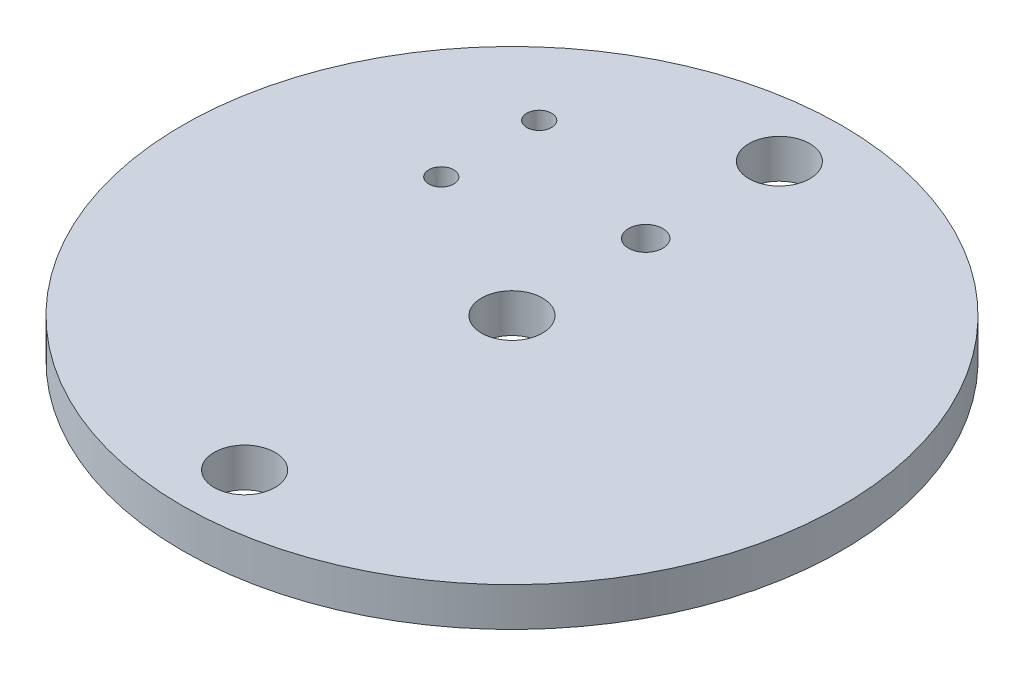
ISO-10303-21;
HEADER;
FILE_DESCRIPTION(('STEP AP214'),'2;1');
FILE_NAME('part.step','',(''),(''),'','','');
FILE_SCHEMA(('AUTOMOTIVE_DESIGN { 1 0 10303 214 1 1 1 1 }'));
ENDSEC;
DATA;
#1=APPLICATION_CONTEXT('core data for automotive mechanical design processes');
#2=APPLICATION_PROTOCOL_DEFINITION('international standard','automotive_design',2000,#1);
#3=PRODUCT_CONTEXT('',#1,'mechanical');
#4=PRODUCT('Part','Part','',(#3));
#5=PRODUCT_RELATED_PRODUCT_CATEGORY('part','',(#4));
#6=PRODUCT_DEFINITION_FORMATION('','',#4);
#7=PRODUCT_DEFINITION_CONTEXT('part definition',#1,'design');
#8=PRODUCT_DEFINITION('design','',#6,#7);
#9=PRODUCT_DEFINITION_SHAPE('','',#8);
#10=(LENGTH_UNIT() NAMED_UNIT(*) SI_UNIT(.MILLI.,.METRE.));
#11=(NAMED_UNIT(*) PLANE_ANGLE_UNIT() SI_UNIT($,.RADIAN.));
#12=(NAMED_UNIT(*) SI_UNIT($,.STERADIAN.) SOLID_ANGLE_UNIT());
#13=UNCERTAINTY_MEASURE_WITH_UNIT(LENGTH_MEASURE(1.E-05),#10,'distance_accuracy_value','');
#14=(GEOMETRIC_REPRESENTATION_CONTEXT(3) GLOBAL_UNCERTAINTY_ASSIGNED_CONTEXT((#13)) GLOBAL_UNIT_ASSIGNED_CONTEXT((#10,
#11,#12)) REPRESENTATION_CONTEXT('',''));
#15=CARTESIAN_POINT('',(0.,0.,0.));
#16=DIRECTION('',(0.,0.,1.));
#17=DIRECTION('',(1.,0.,0.));
#18=AXIS2_PLACEMENT_3D('',#15,#16,#17);
#19=CARTESIAN_POINT('',(0.,3.175,0.));
#20=DIRECTION('',(0.,-1.,0.));
#21=DIRECTION('',(0.,0.,-1.));
#22=AXIS2_PLACEMENT_3D('',#19,#20,#21);
#23=CYLINDRICAL_SURFACE('',#22,26.924);
#24=CARTESIAN_POINT('',(0.,3.175,0.));
#25=DIRECTION('',(0.,1.,0.));
#26=DIRECTION('',(0.,0.,1.));
#27=AXIS2_PLACEMENT_3D('',#24,#25,#26);
#28=CIRCLE('',#27,26.924);
#29=CARTESIAN_POINT('',(0.,3.175,26.924));
#30=VERTEX_POINT('',#29);
#31=EDGE_CURVE('E10',#30,#30,#28,.T.);
#32=ORIENTED_EDGE('',*,*,#31,.F.);
#33=EDGE_LOOP('',(#32));
#34=FACE_BOUND('',#33,.T.);
#35=CARTESIAN_POINT('',(0.,0.,0.));
#36=DIRECTION('',(0.,1.,0.));
#37=DIRECTION('',(0.,0.,1.));
#38=AXIS2_PLACEMENT_3D('',#35,#36,#37);
#39=CIRCLE('',#38,26.924);
#40=CARTESIAN_POINT('',(0.,0.,26.924));
#41=VERTEX_POINT('',#40);
#42=EDGE_CURVE('E42',#41,#41,#39,.T.);
#43=ORIENTED_EDGE('',*,*,#42,.T.);
#44=EDGE_LOOP('',(#43));
#45=FACE_BOUND('',#44,.T.);
#46=ADVANCED_FACE('F39',(#34,#45),#23,.T.);
#47=CARTESIAN_POINT('',(0.,3.175,0.));
#48=DIRECTION('',(0.,1.,0.));
#49=DIRECTION('',(0.,0.,1.));
#50=AXIS2_PLACEMENT_3D('',#47,#48,#49);
#51=PLANE('',#50);
#52=CARTESIAN_POINT('',(0.,3.175,-10.922));
#53=DIRECTION('',(0.,1.,0.));
#54=DIRECTION('',(0.,0.,1.));
#55=AXIS2_PLACEMENT_3D('',#52,#53,#54);
#56=CIRCLE('',#55,1.4);
#57=CARTESIAN_POINT('',(0.,3.175,-9.522));
#58=VERTEX_POINT('',#57);
#59=EDGE_CURVE('E93',#58,#58,#56,.T.);
#60=ORIENTED_EDGE('',*,*,#59,.F.);
#61=EDGE_LOOP('',(#60));
#62=FACE_BOUND('',#61,.T.);
#63=CARTESIAN_POINT('',(-12.7,3.175,-14.922));
#64=DIRECTION('',(0.,1.,0.));
#65=DIRECTION('',(0.,0.,1.));
#66=AXIS2_PLACEMENT_3D('',#63,#64,#65);
#67=CIRCLE('',#66,1.016);
#68=CARTESIAN_POINT('',(-12.7,3.175,-13.906));
#69=VERTEX_POINT('',#68);
#70=EDGE_CURVE('E85',#69,#69,#67,.T.);
#71=ORIENTED_EDGE('',*,*,#70,.F.);
#72=EDGE_LOOP('',(#71));
#73=FACE_BOUND('',#72,.T.);
#74=CARTESIAN_POINT('',(-12.7,3.175,-6.922));
#75=DIRECTION('',(0.,1.,0.));
#76=DIRECTION('',(0.,0.,1.));
#77=AXIS2_PLACEMENT_3D('',#74,#75,#76);
#78=CIRCLE('',#77,1.016);
#79=CARTESIAN_POINT('',(-12.7,3.175,-5.906));
#80=VERTEX_POINT('',#79);
#81=EDGE_CURVE('E77',#80,#80,#78,.T.);
#82=ORIENTED_EDGE('',*,*,#81,.F.);
#83=EDGE_LOOP('',(#82));
#84=FACE_BOUND('',#83,.T.);
#85=CARTESIAN_POINT('',(0.,3.175,0.));
#86=DIRECTION('',(0.,1.,0.));
#87=DIRECTION('',(0.,0.,1.));
#88=AXIS2_PLACEMENT_3D('',#85,#86,#87);
#89=CIRCLE('',#88,2.4892);
#90=CARTESIAN_POINT('',(0.,3.175,2.4892));
#91=VERTEX_POINT('',#90);
#92=EDGE_CURVE('E72',#91,#91,#89,.T.);
#93=ORIENTED_EDGE('',*,*,#92,.F.);
#94=EDGE_LOOP('',(#93));
#95=FACE_BOUND('',#94,.T.);
#96=CARTESIAN_POINT('',(0.,3.175,21.844));
#97=DIRECTION('',(0.,1.,0.));
#98=DIRECTION('',(0.,0.,1.));
#99=AXIS2_PLACEMENT_3D('',#96,#97,#98);
#100=CIRCLE('',#99,2.4892);
#101=CARTESIAN_POINT('',(0.,3.175,24.3332));
#102=VERTEX_POINT('',#101);
#103=EDGE_CURVE('E64',#102,#102,#100,.T.);
#104=ORIENTED_EDGE('',*,*,#103,.F.);
#105=EDGE_LOOP('',(#104));
#106=FACE_BOUND('',#105,.T.);
#107=CARTESIAN_POINT('',(0.,3.175,-21.844));
#108=DIRECTION('',(0.,1.,0.));
#109=DIRECTION('',(0.,0.,1.));
#110=AXIS2_PLACEMENT_3D('',#107,#108,#109);
#111=CIRCLE('',#110,2.4892);
#112=CARTESIAN_POINT('',(0.,3.175,-19.3548));
#113=VERTEX_POINT('',#112);
#114=EDGE_CURVE('E56',#113,#113,#111,.T.);
#115=ORIENTED_EDGE('',*,*,#114,.F.);
#116=EDGE_LOOP('',(#115));
#117=FACE_BOUND('',#116,.T.);
#118=ORIENTED_EDGE('',*,*,#31,.T.);
#119=EDGE_LOOP('',(#118));
#120=FACE_BOUND('',#119,.T.);
#121=ADVANCED_FACE('F111',(#62,#73,#84,#95,#106,#117,#120),#51,.T.);
#122=CARTESIAN_POINT('',(0.,0.,0.));
#123=DIRECTION('',(0.,1.,0.));
#124=DIRECTION('',(0.,0.,1.));
#125=AXIS2_PLACEMENT_3D('',#122,#123,#124);
#126=PLANE('',#125);
#127=CARTESIAN_POINT('',(0.,0.,-10.922));
#128=DIRECTION('',(0.,1.,0.));
#129=DIRECTION('',(0.,0.,1.));
#130=AXIS2_PLACEMENT_3D('',#127,#128,#129);
#131=CIRCLE('',#130,1.4);
#132=CARTESIAN_POINT('',(0.,0.,-9.522));
#133=VERTEX_POINT('',#132);
#134=EDGE_CURVE('E76',#133,#133,#131,.T.);
#135=ORIENTED_EDGE('',*,*,#134,.T.);
#136=EDGE_LOOP('',(#135));
#137=FACE_BOUND('',#136,.T.);
#138=CARTESIAN_POINT('',(-12.7,0.,-14.922));
#139=DIRECTION('',(0.,1.,0.));
#140=DIRECTION('',(0.,0.,1.));
#141=AXIS2_PLACEMENT_3D('',#138,#139,#140);
#142=CIRCLE('',#141,1.016);
#143=CARTESIAN_POINT('',(-12.7,0.,-13.906));
#144=VERTEX_POINT('',#143);
#145=EDGE_CURVE('E89',#144,#144,#142,.T.);
#146=ORIENTED_EDGE('',*,*,#145,.T.);
#147=EDGE_LOOP('',(#146));
#148=FACE_BOUND('',#147,.T.);
#149=CARTESIAN_POINT('',(-12.7,0.,-6.922));
#150=DIRECTION('',(0.,1.,0.));
#151=DIRECTION('',(0.,0.,1.));
#152=AXIS2_PLACEMENT_3D('',#149,#150,#151);
#153=CIRCLE('',#152,1.016);
#154=CARTESIAN_POINT('',(-12.7,0.,-5.906));
#155=VERTEX_POINT('',#154);
#156=EDGE_CURVE('E81',#155,#155,#153,.T.);
#157=ORIENTED_EDGE('',*,*,#156,.T.);
#158=EDGE_LOOP('',(#157));
#159=FACE_BOUND('',#158,.T.);
#160=CARTESIAN_POINT('',(0.,0.,0.));
#161=DIRECTION('',(0.,1.,0.));
#162=DIRECTION('',(0.,0.,1.));
#163=AXIS2_PLACEMENT_3D('',#160,#161,#162);
#164=CIRCLE('',#163,2.4892);
#165=CARTESIAN_POINT('',(0.,0.,2.4892));
#166=VERTEX_POINT('',#165);
#167=EDGE_CURVE('E68',#166,#166,#164,.T.);
#168=ORIENTED_EDGE('',*,*,#167,.T.);
#169=EDGE_LOOP('',(#168));
#170=FACE_BOUND('',#169,.T.);
#171=CARTESIAN_POINT('',(0.,0.,21.844));
#172=DIRECTION('',(0.,1.,0.));
#173=DIRECTION('',(0.,0.,1.));
#174=AXIS2_PLACEMENT_3D('',#171,#172,#173);
#175=CIRCLE('',#174,2.4892);
#176=CARTESIAN_POINT('',(0.,0.,24.3332));
#177=VERTEX_POINT('',#176);
#178=EDGE_CURVE('E60',#177,#177,#175,.T.);
#179=ORIENTED_EDGE('',*,*,#178,.T.);
#180=EDGE_LOOP('',(#179));
#181=FACE_BOUND('',#180,.T.);
#182=CARTESIAN_POINT('',(0.,0.,-21.844));
#183=DIRECTION('',(0.,1.,0.));
#184=DIRECTION('',(0.,0.,1.));
#185=AXIS2_PLACEMENT_3D('',#182,#183,#184);
#186=CIRCLE('',#185,2.4892);
#187=CARTESIAN_POINT('',(0.,0.,-19.3548));
#188=VERTEX_POINT('',#187);
#189=EDGE_CURVE('E51',#188,#188,#186,.T.);
#190=ORIENTED_EDGE('',*,*,#189,.T.);
#191=EDGE_LOOP('',(#190));
#192=FACE_BOUND('',#191,.T.);
#193=ORIENTED_EDGE('',*,*,#42,.F.);
#194=EDGE_LOOP('',(#193));
#195=FACE_BOUND('',#194,.T.);
#196=ADVANCED_FACE('F101',(#137,#148,#159,#170,#181,#192,#195),#126,.F.);
#197=CARTESIAN_POINT('',(0.,3.175,-21.844));
#198=DIRECTION('',(0.,1.,0.));
#199=DIRECTION('',(0.,0.,1.));
#200=AXIS2_PLACEMENT_3D('',#197,#198,#199);
#201=CYLINDRICAL_SURFACE('',#200,2.4892);
#202=ORIENTED_EDGE('',*,*,#189,.F.);
#203=EDGE_LOOP('',(#202));
#204=FACE_BOUND('',#203,.T.);
#205=ORIENTED_EDGE('',*,*,#114,.T.);
#206=EDGE_LOOP('',(#205));
#207=FACE_BOUND('',#206,.T.);
#208=ADVANCED_FACE('F125',(#204,#207),#201,.F.);
#209=CARTESIAN_POINT('',(0.,3.175,21.844));
#210=DIRECTION('',(0.,1.,0.));
#211=DIRECTION('',(0.,0.,1.));
#212=AXIS2_PLACEMENT_3D('',#209,#210,#211);
#213=CYLINDRICAL_SURFACE('',#212,2.4892);
#214=ORIENTED_EDGE('',*,*,#178,.F.);
#215=EDGE_LOOP('',(#214));
#216=FACE_BOUND('',#215,.T.);
#217=ORIENTED_EDGE('',*,*,#103,.T.);
#218=EDGE_LOOP('',(#217));
#219=FACE_BOUND('',#218,.T.);
#220=ADVANCED_FACE('F127',(#216,#219),#213,.F.);
#221=CARTESIAN_POINT('',(0.,3.175,0.));
#222=DIRECTION('',(0.,1.,0.));
#223=DIRECTION('',(0.,0.,1.));
#224=AXIS2_PLACEMENT_3D('',#221,#222,#223);
#225=CYLINDRICAL_SURFACE('',#224,2.4892);
#226=ORIENTED_EDGE('',*,*,#167,.F.);
#227=EDGE_LOOP('',(#226));
#228=FACE_BOUND('',#227,.T.);
#229=ORIENTED_EDGE('',*,*,#92,.T.);
#230=EDGE_LOOP('',(#229));
#231=FACE_BOUND('',#230,.T.);
#232=ADVANCED_FACE('F134',(#228,#231),#225,.F.);
#233=CARTESIAN_POINT('',(-12.7,0.,-6.922));
#234=DIRECTION('',(0.,1.,0.));
#235=DIRECTION('',(0.,0.,1.));
#236=AXIS2_PLACEMENT_3D('',#233,#234,#235);
#237=CYLINDRICAL_SURFACE('',#236,1.016);
#238=ORIENTED_EDGE('',*,*,#156,.F.);
#239=EDGE_LOOP('',(#238));
#240=FACE_BOUND('',#239,.T.);
#241=ORIENTED_EDGE('',*,*,#81,.T.);
#242=EDGE_LOOP('',(#241));
#243=FACE_BOUND('',#242,.T.);
#244=ADVANCED_FACE('F160',(#240,#243),#237,.F.);
#245=CARTESIAN_POINT('',(-12.7,0.,-14.922));
#246=DIRECTION('',(0.,1.,0.));
#247=DIRECTION('',(0.,0.,1.));
#248=AXIS2_PLACEMENT_3D('',#245,#246,#247);
#249=CYLINDRICAL_SURFACE('',#248,1.016);
#250=ORIENTED_EDGE('',*,*,#145,.F.);
#251=EDGE_LOOP('',(#250));
#252=FACE_BOUND('',#251,.T.);
#253=ORIENTED_EDGE('',*,*,#70,.T.);
#254=EDGE_LOOP('',(#253));
#255=FACE_BOUND('',#254,.T.);
#256=ADVANCED_FACE('F107',(#252,#255),#249,.F.);
#257=CARTESIAN_POINT('',(0.,0.,-10.922));
#258=DIRECTION('',(0.,1.,0.));
#259=DIRECTION('',(0.,0.,1.));
#260=AXIS2_PLACEMENT_3D('',#257,#258,#259);
#261=CYLINDRICAL_SURFACE('',#260,1.4);
#262=ORIENTED_EDGE('',*,*,#134,.F.);
#263=EDGE_LOOP('',(#262));
#264=FACE_BOUND('',#263,.T.);
#265=ORIENTED_EDGE('',*,*,#59,.T.);
#266=EDGE_LOOP('',(#265));
#267=FACE_BOUND('',#266,.T.);
#268=ADVANCED_FACE('F104',(#264,#267),#261,.F.);
#269=CLOSED_SHELL('',(#46,#121,#196,#208,#220,#232,#244,#256,#268));
#270=MANIFOLD_SOLID_BREP('B2',#269);
#271=ADVANCED_BREP_SHAPE_REPRESENTATION('',(#18,#270),#14);
#272=SHAPE_DEFINITION_REPRESENTATION(#9,#271);
ENDSEC;
END-ISO-10303-21;
